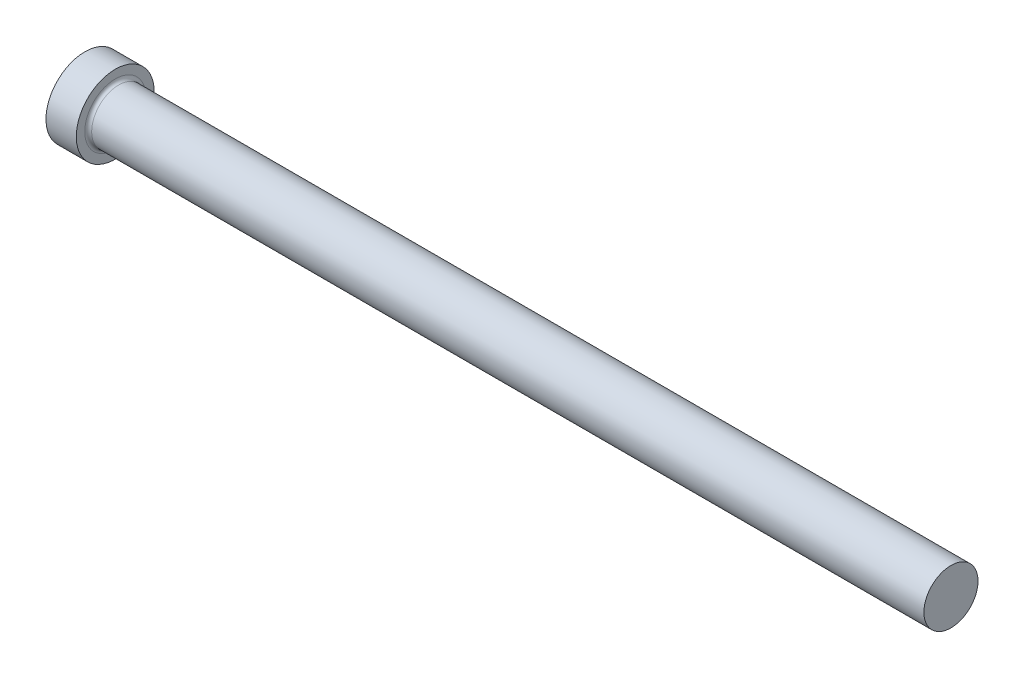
ISO-10303-21;
HEADER;
FILE_DESCRIPTION(('STEP AP214'),'2;1');
FILE_NAME('part.step','',(''),(''),'','','');
FILE_SCHEMA(('AUTOMOTIVE_DESIGN { 1 0 10303 214 1 1 1 1 }'));
ENDSEC;
DATA;
#1=APPLICATION_CONTEXT('core data for automotive mechanical design processes');
#2=APPLICATION_PROTOCOL_DEFINITION('international standard','automotive_design',2000,#1);
#3=PRODUCT_CONTEXT('',#1,'mechanical');
#4=PRODUCT('Part','Part','',(#3));
#5=PRODUCT_RELATED_PRODUCT_CATEGORY('part','',(#4));
#6=PRODUCT_DEFINITION_FORMATION('','',#4);
#7=PRODUCT_DEFINITION_CONTEXT('part definition',#1,'design');
#8=PRODUCT_DEFINITION('design','',#6,#7);
#9=PRODUCT_DEFINITION_SHAPE('','',#8);
#10=(LENGTH_UNIT() NAMED_UNIT(*) SI_UNIT(.MILLI.,.METRE.));
#11=(NAMED_UNIT(*) PLANE_ANGLE_UNIT() SI_UNIT($,.RADIAN.));
#12=(NAMED_UNIT(*) SI_UNIT($,.STERADIAN.) SOLID_ANGLE_UNIT());
#13=UNCERTAINTY_MEASURE_WITH_UNIT(LENGTH_MEASURE(1.E-05),#10,'distance_accuracy_value','');
#14=(GEOMETRIC_REPRESENTATION_CONTEXT(3) GLOBAL_UNCERTAINTY_ASSIGNED_CONTEXT((#13)) GLOBAL_UNIT_ASSIGNED_CONTEXT((#10,
#11,#12)) REPRESENTATION_CONTEXT('',''));
#15=CARTESIAN_POINT('',(0.,0.,0.));
#16=DIRECTION('',(0.,0.,1.));
#17=DIRECTION('',(1.,0.,0.));
#18=AXIS2_PLACEMENT_3D('',#15,#16,#17);
#19=CARTESIAN_POINT('',(0.,0.,0.));
#20=DIRECTION('',(-1.,0.,0.));
#21=DIRECTION('',(0.,-1.,0.));
#22=AXIS2_PLACEMENT_3D('',#19,#20,#21);
#23=PLANE('',#22);
#24=CARTESIAN_POINT('',(0.,0.,0.));
#25=DIRECTION('',(1.,0.,0.));
#26=DIRECTION('',(0.,1.,0.));
#27=AXIS2_PLACEMENT_3D('',#24,#25,#26);
#28=CIRCLE('',#27,9.);
#29=CARTESIAN_POINT('',(0.,9.,0.));
#30=VERTEX_POINT('',#29);
#31=EDGE_CURVE('E25',#30,#30,#28,.T.);
#32=ORIENTED_EDGE('',*,*,#31,.F.);
#33=EDGE_LOOP('',(#32));
#34=FACE_BOUND('',#33,.T.);
#35=ADVANCED_FACE('F14',(#34),#23,.T.);
#36=CARTESIAN_POINT('',(200.,0.,0.));
#37=DIRECTION('',(1.,0.,0.));
#38=DIRECTION('',(0.,1.,0.));
#39=AXIS2_PLACEMENT_3D('',#36,#37,#38);
#40=CYLINDRICAL_SURFACE('',#39,9.);
#41=ORIENTED_EDGE('',*,*,#31,.T.);
#42=EDGE_LOOP('',(#41));
#43=FACE_BOUND('',#42,.T.);
#44=CARTESIAN_POINT('',(7.,0.,0.));
#45=DIRECTION('',(1.,0.,0.));
#46=DIRECTION('',(0.,1.,0.));
#47=AXIS2_PLACEMENT_3D('',#44,#45,#46);
#48=CIRCLE('',#47,9.);
#49=CARTESIAN_POINT('',(7.,9.,0.));
#50=VERTEX_POINT('',#49);
#51=EDGE_CURVE('E29',#50,#50,#48,.T.);
#52=ORIENTED_EDGE('',*,*,#51,.F.);
#53=EDGE_LOOP('',(#52));
#54=FACE_BOUND('',#53,.T.);
#55=ADVANCED_FACE('F51',(#43,#54),#40,.T.);
#56=CARTESIAN_POINT('',(7.,9.,0.));
#57=DIRECTION('',(1.,0.,0.));
#58=DIRECTION('',(0.,1.,0.));
#59=AXIS2_PLACEMENT_3D('',#56,#57,#58);
#60=PLANE('',#59);
#61=CARTESIAN_POINT('',(7.,0.,0.));
#62=DIRECTION('',(1.,0.,0.));
#63=DIRECTION('',(0.,1.,0.));
#64=AXIS2_PLACEMENT_3D('',#61,#62,#63);
#65=CIRCLE('',#64,7.05);
#66=CARTESIAN_POINT('',(7.,7.05,0.));
#67=VERTEX_POINT('',#66);
#68=EDGE_CURVE('E9',#67,#67,#65,.F.);
#69=ORIENTED_EDGE('',*,*,#68,.T.);
#70=EDGE_LOOP('',(#69));
#71=FACE_BOUND('',#70,.T.);
#72=ORIENTED_EDGE('',*,*,#51,.T.);
#73=EDGE_LOOP('',(#72));
#74=FACE_BOUND('',#73,.T.);
#75=ADVANCED_FACE('F42',(#71,#74),#60,.T.);
#76=CARTESIAN_POINT('',(200.,0.,0.));
#77=DIRECTION('',(1.,0.,0.));
#78=DIRECTION('',(0.,1.,0.));
#79=AXIS2_PLACEMENT_3D('',#76,#77,#78);
#80=CYLINDRICAL_SURFACE('',#79,6.25);
#81=CARTESIAN_POINT('',(7.8,0.,0.));
#82=DIRECTION('',(1.,0.,0.));
#83=DIRECTION('',(0.,1.,0.));
#84=AXIS2_PLACEMENT_3D('',#81,#82,#83);
#85=CIRCLE('',#84,6.25);
#86=CARTESIAN_POINT('',(7.8,6.25,0.));
#87=VERTEX_POINT('',#86);
#88=EDGE_CURVE('E21',#87,#87,#85,.T.);
#89=ORIENTED_EDGE('',*,*,#88,.T.);
#90=EDGE_LOOP('',(#89));
#91=FACE_BOUND('',#90,.T.);
#92=CARTESIAN_POINT('',(200.,0.,0.));
#93=DIRECTION('',(1.,0.,0.));
#94=DIRECTION('',(0.,1.,0.));
#95=AXIS2_PLACEMENT_3D('',#92,#93,#94);
#96=CIRCLE('',#95,6.25);
#97=CARTESIAN_POINT('',(200.,6.25000000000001,0.));
#98=VERTEX_POINT('',#97);
#99=EDGE_CURVE('E34',#98,#98,#96,.T.);
#100=ORIENTED_EDGE('',*,*,#99,.F.);
#101=EDGE_LOOP('',(#100));
#102=FACE_BOUND('',#101,.T.);
#103=ADVANCED_FACE('F40',(#91,#102),#80,.T.);
#104=CARTESIAN_POINT('',(200.,6.25,0.));
#105=DIRECTION('',(1.,0.,0.));
#106=DIRECTION('',(0.,1.,0.));
#107=AXIS2_PLACEMENT_3D('',#104,#105,#106);
#108=PLANE('',#107);
#109=ORIENTED_EDGE('',*,*,#99,.T.);
#110=EDGE_LOOP('',(#109));
#111=FACE_BOUND('',#110,.T.);
#112=ADVANCED_FACE('F38',(#111),#108,.T.);
#113=CARTESIAN_POINT('',(7.8,0.,0.));
#114=DIRECTION('',(1.,0.,0.));
#115=DIRECTION('',(0.,1.,0.));
#116=AXIS2_PLACEMENT_3D('',#113,#114,#115);
#117=TOROIDAL_SURFACE('',#116,7.05,0.8);
#118=ORIENTED_EDGE('',*,*,#68,.F.);
#119=EDGE_LOOP('',(#118));
#120=FACE_BOUND('',#119,.T.);
#121=ORIENTED_EDGE('',*,*,#88,.F.);
#122=EDGE_LOOP('',(#121));
#123=FACE_BOUND('',#122,.T.);
#124=ADVANCED_FACE('F16',(#120,#123),#117,.F.);
#125=CLOSED_SHELL('',(#35,#55,#75,#103,#112,#124));
#126=MANIFOLD_SOLID_BREP('B1',#125);
#127=ADVANCED_BREP_SHAPE_REPRESENTATION('',(#18,#126),#14);
#128=SHAPE_DEFINITION_REPRESENTATION(#9,#127);
ENDSEC;
END-ISO-10303-21;
